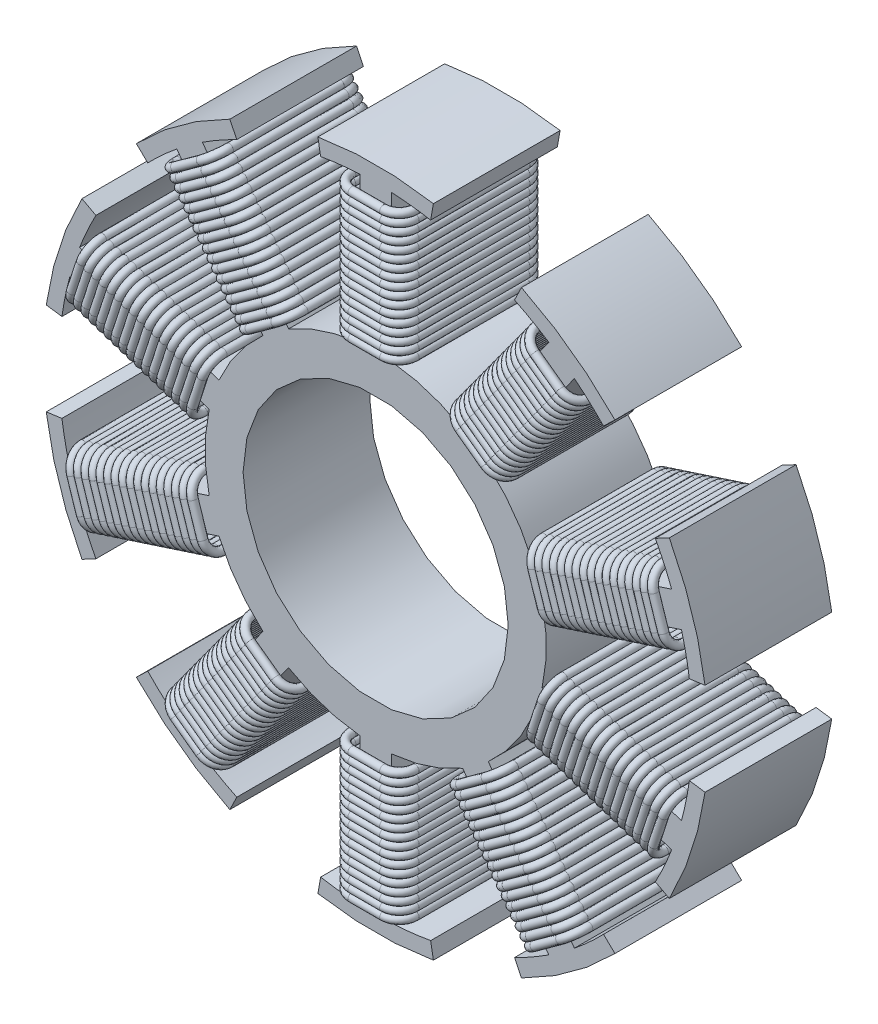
from build123d import *

# Parameters (mm, degrees)
SKETCH1_R            = 10.77
SKETCH1_R_2          = 8.37
BOSS_EXTRUDE1_DEPTH  = 8
BOSS_EXTRUDE2_DEPTH  = 8
SWEEP4_PROFILE_R     = 0.25
LPATTERN36_COUNT     = 17
LPATTERN36_PITCH     = 0.5
CIRPATTERN1_COUNT    = 10
CIRPATTERN2_COUNT    = 10
CIRPATTERN2_2_COUNT  = 10
CIRPATTERN2_3_COUNT  = 10
CIRPATTERN2_4_COUNT  = 10
CIRPATTERN2_5_COUNT  = 10
CIRPATTERN2_6_COUNT  = 10
CIRPATTERN2_7_COUNT  = 10
CIRPATTERN2_8_COUNT  = 10
CIRPATTERN2_9_COUNT  = 10
CIRPATTERN2_10_COUNT = 10
CIRPATTERN2_11_COUNT = 10
CIRPATTERN2_12_COUNT = 10
CIRPATTERN2_13_COUNT = 10
CIRPATTERN2_14_COUNT = 10
CIRPATTERN2_15_COUNT = 10
CIRPATTERN2_16_COUNT = 10
CIRPATTERN2_17_COUNT = 10


with BuildPart() as part:
    # Sketch1 → Boss-Extrude1 (new body)
    with BuildSketch(Plane.XY):
        Circle(SKETCH1_R)
        Circle(SKETCH1_R_2, mode=Mode.SUBTRACT)
    extrude(amount=BOSS_EXTRUDE1_DEPTH)

    # Sketch1_5 → Boss-Extrude2 (add)
    with BuildSketch(Plane.XY):
        with BuildLine():
            ThreePointArc((3.646611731, 20.680962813), (0, 21), (-3.646611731, 20.680962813))
            Line((-3.646611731, 20.680962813), (-3.472963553, 19.69615506))
            ThreePointArc((-3.472963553, 19.69615506), (-2.24082288, 19.87407137), (-1, 19.974984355))
            Line((-1, 19.974984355), (-1, 10.72347425))
            ThreePointArc((-1, 10.72347425), (0, 10.77), (1, 10.72347425))
            Line((1, 10.72347425), (1, 19.974984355))
            ThreePointArc((1, 19.974984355), (2.24082288, 19.87407137), (3.472963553, 19.69615506))
            Line((3.472963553, 19.69615506), (3.646611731, 20.680962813))
        make_face()
    boss_extrude2 = extrude(amount=BOSS_EXTRUDE2_DEPTH)

    # CirPattern1: Boss-Extrude2 ×10 about axis
    cirpattern1_axis = Axis((0, 0, 0), (0, 0, 1))
    for i in range(1, CIRPATTERN1_COUNT):
        add(boss_extrude2.rotate(cirpattern1_axis, i * 360 / CIRPATTERN1_COUNT))


with BuildPart() as body_2:
    # Sweep4: sweep along a path in Sketch2
    with BuildLine(Plane(origin=(0, 11.3, 0), x_dir=(1, 0, 0), z_dir=(0, 1, 0))) as sweep4_path:
        Line((-1, -8.5), (1, -8.5))
        ThreePointArc((1, -8.5), (1.707106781, -8.207106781), (2, -7.5))
        Line((2, -7.5), (2, -0.5))
        ThreePointArc((2, -0.5), (1.707106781, 0.207106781), (1, 0.5))
        Line((1, 0.5), (-1, 0.5))
        ThreePointArc((-1, 0.5), (-1.707106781, 0.207106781), (-2, -0.5))
        Line((-2, -0.5), (-2, -7.5))
        ThreePointArc((-2, -7.5), (-1.707106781, -8.207106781), (-1, -8.5))
    # Sweep4 profile (on start of the path) → Sweep4 (sweep)
    with BuildSketch(Plane(origin=(-1, 11.3, 8.5), x_dir=(0, 0, 1), z_dir=(1, 0, 0))):
        Circle(SWEEP4_PROFILE_R)
    sweep(path=sweep4_path.line)


with BuildPart() as lpattern36_1:
    # LPattern36: pattern copy
    add(body_2.part.moved(Location(Vector(0, 1, 0) * (1 * LPATTERN36_PITCH))))

    # CirPattern2 16: LPattern36_1 ×10 about axis
    cirpattern2_16_axis = Axis((0, 0, 0), (0, 0, 1))


with BuildPart() as lpattern36_2:
    # LPattern36: pattern copy
    add(body_2.part.moved(Location(Vector(0, 1, 0) * (2 * LPATTERN36_PITCH))))

    # CirPattern2 15: LPattern36_2 ×10 about axis
    cirpattern2_15_axis = Axis((0, 0, 0), (0, 0, 1))


with BuildPart() as lpattern36_3:
    # LPattern36: pattern copy
    add(body_2.part.moved(Location(Vector(0, 1, 0) * (3 * LPATTERN36_PITCH))))

    # CirPattern2 14: LPattern36_3 ×10 about axis
    cirpattern2_14_axis = Axis((0, 0, 0), (0, 0, 1))


with BuildPart() as lpattern36_4:
    # LPattern36: pattern copy
    add(body_2.part.moved(Location(Vector(0, 1, 0) * (4 * LPATTERN36_PITCH))))

    # CirPattern2 13: LPattern36_4 ×10 about axis
    cirpattern2_13_axis = Axis((0, 0, 0), (0, 0, 1))


with BuildPart() as lpattern36_5:
    # LPattern36: pattern copy
    add(body_2.part.moved(Location(Vector(0, 1, 0) * (5 * LPATTERN36_PITCH))))

    # CirPattern2 12: LPattern36_5 ×10 about axis
    cirpattern2_12_axis = Axis((0, 0, 0), (0, 0, 1))


with BuildPart() as lpattern36_6:
    # LPattern36: pattern copy
    add(body_2.part.moved(Location(Vector(0, 1, 0) * (6 * LPATTERN36_PITCH))))

    # CirPattern2 11: LPattern36_6 ×10 about axis
    cirpattern2_11_axis = Axis((0, 0, 0), (0, 0, 1))


with BuildPart() as lpattern36_7:
    # LPattern36: pattern copy
    add(body_2.part.moved(Location(Vector(0, 1, 0) * (7 * LPATTERN36_PITCH))))

    # CirPattern2 10: LPattern36_7 ×10 about axis
    cirpattern2_10_axis = Axis((0, 0, 0), (0, 0, 1))


with BuildPart() as lpattern36_8:
    # LPattern36: pattern copy
    add(body_2.part.moved(Location(Vector(0, 1, 0) * (8 * LPATTERN36_PITCH))))

    # CirPattern2 8: LPattern36_8 ×10 about axis
    cirpattern2_8_axis = Axis((0, 0, 0), (0, 0, 1))


with BuildPart() as lpattern36_9:
    # LPattern36: pattern copy
    add(body_2.part.moved(Location(Vector(0, 1, 0) * (9 * LPATTERN36_PITCH))))

    # CirPattern2 9: LPattern36_9 ×10 about axis
    cirpattern2_9_axis = Axis((0, 0, 0), (0, 0, 1))


with BuildPart() as lpattern36_10:
    # LPattern36: pattern copy
    add(body_2.part.moved(Location(Vector(0, 1, 0) * (10 * LPATTERN36_PITCH))))

    # CirPattern2 7: LPattern36_10 ×10 about axis
    cirpattern2_7_axis = Axis((0, 0, 0), (0, 0, 1))


with BuildPart() as lpattern36_11:
    # LPattern36: pattern copy
    add(body_2.part.moved(Location(Vector(0, 1, 0) * (11 * LPATTERN36_PITCH))))

    # CirPattern2 6: LPattern36_11 ×10 about axis
    cirpattern2_6_axis = Axis((0, 0, 0), (0, 0, 1))


with BuildPart() as lpattern36_12:
    # LPattern36: pattern copy
    add(body_2.part.moved(Location(Vector(0, 1, 0) * (12 * LPATTERN36_PITCH))))

    # CirPattern2 5: LPattern36_12 ×10 about axis
    cirpattern2_5_axis = Axis((0, 0, 0), (0, 0, 1))


with BuildPart() as lpattern36_13:
    # LPattern36: pattern copy
    add(body_2.part.moved(Location(Vector(0, 1, 0) * (13 * LPATTERN36_PITCH))))

    # CirPattern2 4: LPattern36_13 ×10 about axis
    cirpattern2_4_axis = Axis((0, 0, 0), (0, 0, 1))


with BuildPart() as lpattern36_14:
    # LPattern36: pattern copy
    add(body_2.part.moved(Location(Vector(0, 1, 0) * (14 * LPATTERN36_PITCH))))

    # CirPattern2 3: LPattern36_14 ×10 about axis
    cirpattern2_3_axis = Axis((0, 0, 0), (0, 0, 1))


with BuildPart() as lpattern36_15:
    # LPattern36: pattern copy
    add(body_2.part.moved(Location(Vector(0, 1, 0) * (15 * LPATTERN36_PITCH))))

    # CirPattern2 2: LPattern36_15 ×10 about axis
    cirpattern2_2_axis = Axis((0, 0, 0), (0, 0, 1))


with BuildPart() as lpattern36_16:
    # LPattern36: pattern copy
    add(body_2.part.moved(Location(Vector(0, 1, 0) * (16 * LPATTERN36_PITCH))))

    # CirPattern2: LPattern36_16 ×10 about axis
    cirpattern2_axis = Axis((0, 0, 0), (0, 0, 1))


with BuildPart() as lpattern36_16_1:
    add(lpattern36_16.part)
    for i in range(1, CIRPATTERN2_COUNT):
        add(lpattern36_16.part.rotate(cirpattern2_axis, i * 360 / CIRPATTERN2_COUNT))


with BuildPart() as lpattern36_15_1:
    add(lpattern36_15.part)
    for i in range(1, CIRPATTERN2_2_COUNT):
        add(lpattern36_15.part.rotate(cirpattern2_2_axis, i * 360 / CIRPATTERN2_2_COUNT))


with BuildPart() as lpattern36_14_1:
    add(lpattern36_14.part)
    for i in range(1, CIRPATTERN2_3_COUNT):
        add(lpattern36_14.part.rotate(cirpattern2_3_axis, i * 360 / CIRPATTERN2_3_COUNT))


with BuildPart() as lpattern36_13_1:
    add(lpattern36_13.part)
    for i in range(1, CIRPATTERN2_4_COUNT):
        add(lpattern36_13.part.rotate(cirpattern2_4_axis, i * 360 / CIRPATTERN2_4_COUNT))


with BuildPart() as lpattern36_12_1:
    add(lpattern36_12.part)
    for i in range(1, CIRPATTERN2_5_COUNT):
        add(lpattern36_12.part.rotate(cirpattern2_5_axis, i * 360 / CIRPATTERN2_5_COUNT))


with BuildPart() as lpattern36_11_1:
    add(lpattern36_11.part)
    for i in range(1, CIRPATTERN2_6_COUNT):
        add(lpattern36_11.part.rotate(cirpattern2_6_axis, i * 360 / CIRPATTERN2_6_COUNT))


with BuildPart() as lpattern36_10_1:
    add(lpattern36_10.part)
    for i in range(1, CIRPATTERN2_7_COUNT):
        add(lpattern36_10.part.rotate(cirpattern2_7_axis, i * 360 / CIRPATTERN2_7_COUNT))


with BuildPart() as lpattern36_8_1:
    add(lpattern36_8.part)
    for i in range(1, CIRPATTERN2_8_COUNT):
        add(lpattern36_8.part.rotate(cirpattern2_8_axis, i * 360 / CIRPATTERN2_8_COUNT))


with BuildPart() as lpattern36_9_1:
    add(lpattern36_9.part)
    for i in range(1, CIRPATTERN2_9_COUNT):
        add(lpattern36_9.part.rotate(cirpattern2_9_axis, i * 360 / CIRPATTERN2_9_COUNT))


with BuildPart() as lpattern36_7_1:
    add(lpattern36_7.part)
    for i in range(1, CIRPATTERN2_10_COUNT):
        add(lpattern36_7.part.rotate(cirpattern2_10_axis, i * 360 / CIRPATTERN2_10_COUNT))


with BuildPart() as lpattern36_6_1:
    add(lpattern36_6.part)
    for i in range(1, CIRPATTERN2_11_COUNT):
        add(lpattern36_6.part.rotate(cirpattern2_11_axis, i * 360 / CIRPATTERN2_11_COUNT))


with BuildPart() as lpattern36_5_1:
    add(lpattern36_5.part)
    for i in range(1, CIRPATTERN2_12_COUNT):
        add(lpattern36_5.part.rotate(cirpattern2_12_axis, i * 360 / CIRPATTERN2_12_COUNT))


with BuildPart() as lpattern36_4_1:
    add(lpattern36_4.part)
    for i in range(1, CIRPATTERN2_13_COUNT):
        add(lpattern36_4.part.rotate(cirpattern2_13_axis, i * 360 / CIRPATTERN2_13_COUNT))


with BuildPart() as lpattern36_3_1:
    add(lpattern36_3.part)
    for i in range(1, CIRPATTERN2_14_COUNT):
        add(lpattern36_3.part.rotate(cirpattern2_14_axis, i * 360 / CIRPATTERN2_14_COUNT))


with BuildPart() as lpattern36_2_1:
    add(lpattern36_2.part)
    for i in range(1, CIRPATTERN2_15_COUNT):
        add(lpattern36_2.part.rotate(cirpattern2_15_axis, i * 360 / CIRPATTERN2_15_COUNT))


with BuildPart() as lpattern36_1_1:
    add(lpattern36_1.part)
    for i in range(1, CIRPATTERN2_16_COUNT):
        add(lpattern36_1.part.rotate(cirpattern2_16_axis, i * 360 / CIRPATTERN2_16_COUNT))


with BuildPart() as body_2_1:
    add(body_2.part)

    # CirPattern2 17: body 2 ×10 about axis
    cirpattern2_17_axis = Axis((0, 0, 0), (0, 0, 1))


with BuildPart() as body_2_2:
    add(body_2_1.part)
    for i in range(1, CIRPATTERN2_17_COUNT):
        add(body_2_1.part.rotate(cirpattern2_17_axis, i * 360 / CIRPATTERN2_17_COUNT))


solid = Compound([part.part, lpattern36_16_1.part, lpattern36_15_1.part, lpattern36_14_1.part, lpattern36_13_1.part, lpattern36_12_1.part, lpattern36_11_1.part, lpattern36_10_1.part, lpattern36_8_1.part, lpattern36_9_1.part, lpattern36_7_1.part, lpattern36_6_1.part, lpattern36_5_1.part, lpattern36_4_1.part, lpattern36_3_1.part, lpattern36_2_1.part, lpattern36_1_1.part, body_2_2.part])
